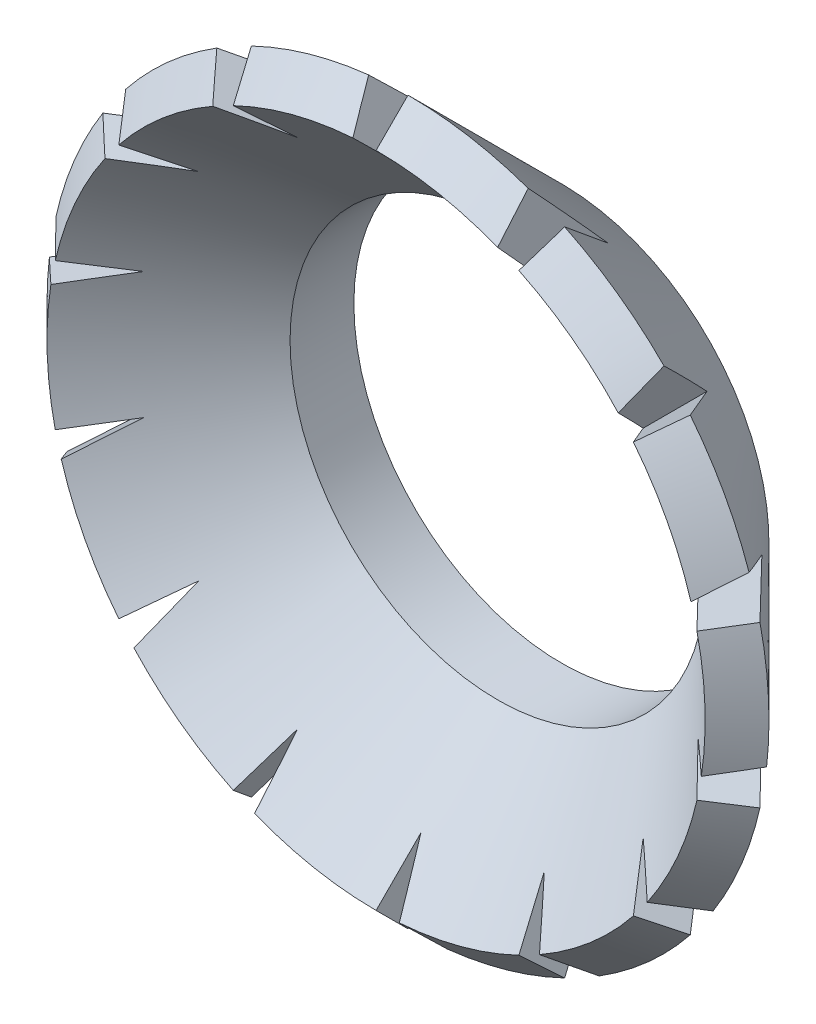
from build123d import *

# Parameters (mm, degrees)
CUT_EXTRUDE1_DEPTH = 7.018062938
TYPEAPATTEN_COUNT  = 14


with BuildPart() as part:
    # Sketch1 → Revolve1 (revolve)
    with BuildSketch(Plane(origin=(0, 0, 0), x_dir=(1, 0, 0), z_dir=(0, 1, 0)), mode=Mode.PRIVATE) as revolve1_sk:
        Polygon((2.3, 0), (4, -1.7), (3.646446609, -2.053553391), (2.3, -0.707106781), align=None)
    revolve(revolve1_sk.sketch.rotate(Axis((0, 0, -3.757972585), (0, 0, 1)), 180), axis=Axis((0, 0, -3.757972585), (0, 0, 1)))

    # Sketch2 → Cut-Extrude1 (cut, through all)
    with BuildSketch(Plane.XY):
        Polygon((0, 4), (-0.448798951, 4), (0, 3.15), align=None)
    cut_extrude1 = extrude(amount=CUT_EXTRUDE1_DEPTH, mode=Mode.SUBTRACT)

    # TypeApatten: Cut-Extrude1 ×14 about axis
    typeapatten_axis = Axis((0, 0, 0), (0, 0, 1))
    for i in range(1, TYPEAPATTEN_COUNT):
        add(cut_extrude1.rotate(typeapatten_axis, i * 360 / TYPEAPATTEN_COUNT), mode=Mode.SUBTRACT)


solid = part.part
